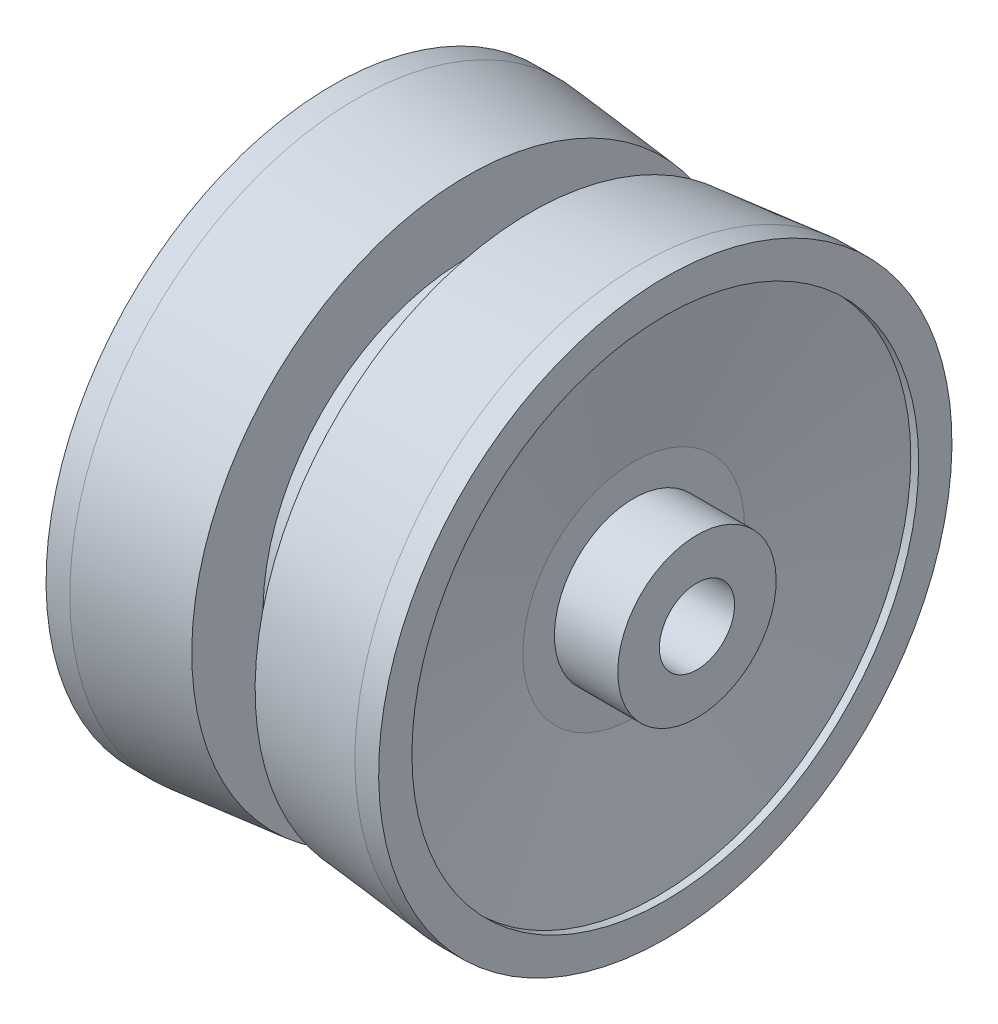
from build123d import *

# Parameters (mm, degrees)
ESQUISSE2_R             = 2.375
ENL_V_MAT_EXTRU_1_DEPTH = 36.780162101


with BuildPart() as part:
    # Esquisse1 → R_volution1 (revolve)
    with BuildSketch(Plane.XY, mode=Mode.PRIVATE) as r_volution1_sk:
        Polygon((-10.5, 18.1), (-10.5, 16), (-10, 16), (-8.5, 7), (-8.5, 5), (-12.5, 5), (-12.5, 0), (12.5, 0), (12.5, 5), (8.5, 5), (8.5, 7), (10, 16), (10.5, 16), (10.5, 18.1), (9, 18.1), (2, 17.4), (2, 12.9), (-2, 12.9), (-2, 17.4), (-9, 18.1), align=None)
    revolve(r_volution1_sk.sketch.rotate(Axis((-61.488945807, 0, 0), (1, 0, 0)), 180), axis=Axis((-61.488945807, 0, 0), (1, 0, 0)))

    # Esquisse2 → Enl_v. mat.-Extru.1 (cut, through all)
    with BuildSketch(Plane(origin=(12.5, 0, 0), x_dir=(0, 0, -1), z_dir=(1, 0, 0))):
        with Locations(Location((0, 0, 0), (0, 0, 90))):
            Circle(ESQUISSE2_R)
    extrude(amount=-ENL_V_MAT_EXTRU_1_DEPTH, mode=Mode.SUBTRACT)


solid = part.part
